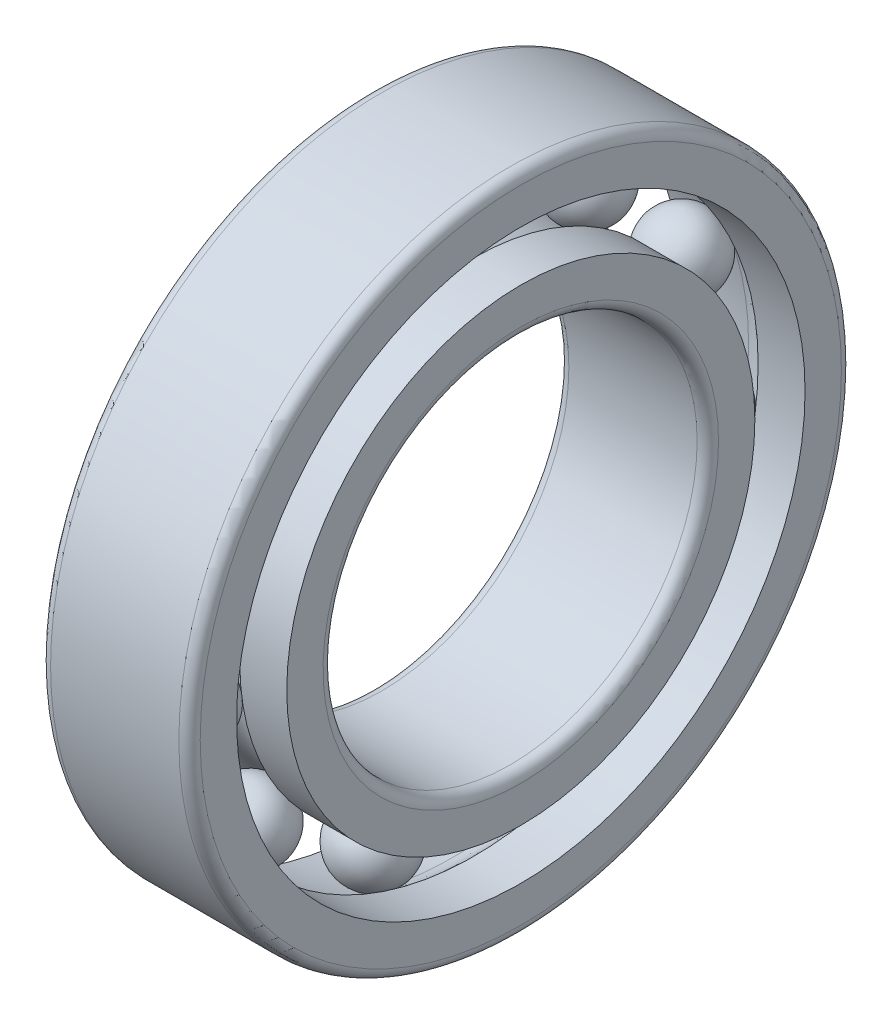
ISO-10303-21;
HEADER;
FILE_DESCRIPTION(('STEP AP214'),'2;1');
FILE_NAME('part.step','',(''),(''),'','','');
FILE_SCHEMA(('AUTOMOTIVE_DESIGN { 1 0 10303 214 1 1 1 1 }'));
ENDSEC;
DATA;
#1=APPLICATION_CONTEXT('core data for automotive mechanical design processes');
#2=APPLICATION_PROTOCOL_DEFINITION('international standard','automotive_design',2000,#1);
#3=PRODUCT_CONTEXT('',#1,'mechanical');
#4=PRODUCT('Part','Part','',(#3));
#5=PRODUCT_RELATED_PRODUCT_CATEGORY('part','',(#4));
#6=PRODUCT_DEFINITION_FORMATION('','',#4);
#7=PRODUCT_DEFINITION_CONTEXT('part definition',#1,'design');
#8=PRODUCT_DEFINITION('design','',#6,#7);
#9=PRODUCT_DEFINITION_SHAPE('','',#8);
#10=(LENGTH_UNIT() NAMED_UNIT(*) SI_UNIT(.MILLI.,.METRE.));
#11=(NAMED_UNIT(*) PLANE_ANGLE_UNIT() SI_UNIT($,.RADIAN.));
#12=(NAMED_UNIT(*) SI_UNIT($,.STERADIAN.) SOLID_ANGLE_UNIT());
#13=UNCERTAINTY_MEASURE_WITH_UNIT(LENGTH_MEASURE(1.E-05),#10,'distance_accuracy_value','');
#14=(GEOMETRIC_REPRESENTATION_CONTEXT(3) GLOBAL_UNCERTAINTY_ASSIGNED_CONTEXT((#13)) GLOBAL_UNIT_ASSIGNED_CONTEXT((#10,
#11,#12)) REPRESENTATION_CONTEXT('',''));
#15=CARTESIAN_POINT('',(0.,0.,0.));
#16=DIRECTION('',(0.,0.,1.));
#17=DIRECTION('',(1.,0.,0.));
#18=AXIS2_PLACEMENT_3D('',#15,#16,#17);
#19=CARTESIAN_POINT('',(7.,-23.2677046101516,6.83201450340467));
#20=DIRECTION('',(1.,0.,0.));
#21=DIRECTION('',(0.,-0.959492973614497,0.28173255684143));
#22=AXIS2_PLACEMENT_3D('',#19,#20,#21);
#23=SPHERICAL_SURFACE('',#22,3.51);
#24=CARTESIAN_POINT('',(3.49,-23.2677046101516,6.83201450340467));
#25=VERTEX_POINT('',#24);
#26=VERTEX_LOOP('',#25);
#27=FACE_BOUND('',#26,.T.);
#28=CARTESIAN_POINT('',(10.51,-23.2677046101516,6.83201450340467));
#29=VERTEX_POINT('',#28);
#30=VERTEX_LOOP('',#29);
#31=FACE_BOUND('',#30,.T.);
#32=ADVANCED_FACE('P0_F15',(#27,#31),#23,.T.);
#33=CLOSED_SHELL('',(#32));
#34=MANIFOLD_SOLID_BREP('P0_B1',#33);
#35=CARTESIAN_POINT('',(7.,0.,0.));
#36=DIRECTION('',(1.,0.,0.));
#37=DIRECTION('',(0.,0.,-1.));
#38=AXIS2_PLACEMENT_3D('',#35,#36,#37);
#39=TOROIDAL_SURFACE('',#38,24.25,3.51);
#40=CARTESIAN_POINT('',(9.60812173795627,0.,0.));
#41=DIRECTION('',(1.,0.,0.));
#42=DIRECTION('',(0.,0.,-1.));
#43=AXIS2_PLACEMENT_3D('',#40,#41,#42);
#44=CIRCLE('',#43,21.901);
#45=CARTESIAN_POINT('',(9.60812173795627,0.,-21.901));
#46=VERTEX_POINT('',#45);
#47=EDGE_CURVE('P1_E110',#46,#46,#44,.T.);
#48=ORIENTED_EDGE('',*,*,#47,.F.);
#49=EDGE_LOOP('',(#48));
#50=FACE_BOUND('',#49,.T.);
#51=CARTESIAN_POINT('',(4.39187826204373,0.,0.));
#52=DIRECTION('',(1.,0.,0.));
#53=DIRECTION('',(0.,0.,-1.));
#54=AXIS2_PLACEMENT_3D('',#51,#52,#53);
#55=CIRCLE('',#54,21.901);
#56=CARTESIAN_POINT('',(4.39187826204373,0.,-21.901));
#57=VERTEX_POINT('',#56);
#58=EDGE_CURVE('P1_E108',#57,#57,#55,.F.);
#59=ORIENTED_EDGE('',*,*,#58,.F.);
#60=EDGE_LOOP('',(#59));
#61=FACE_BOUND('',#60,.T.);
#62=ADVANCED_FACE('P1_F14',(#50,#61),#39,.F.);
#63=CARTESIAN_POINT('',(11.8040608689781,0.,0.));
#64=DIRECTION('',(1.,0.,0.));
#65=DIRECTION('',(0.,0.,-1.));
#66=AXIS2_PLACEMENT_3D('',#63,#64,#65);
#67=CYLINDRICAL_SURFACE('',#66,21.901);
#68=ORIENTED_EDGE('',*,*,#47,.T.);
#69=EDGE_LOOP('',(#68));
#70=FACE_BOUND('',#69,.T.);
#71=CARTESIAN_POINT('',(14.,0.,0.));
#72=DIRECTION('',(1.,0.,0.));
#73=DIRECTION('',(0.,0.,-1.));
#74=AXIS2_PLACEMENT_3D('',#71,#72,#73);
#75=CIRCLE('',#74,21.901);
#76=CARTESIAN_POINT('',(14.,0.,-21.901));
#77=VERTEX_POINT('',#76);
#78=EDGE_CURVE('P1_E17',#77,#77,#75,.T.);
#79=ORIENTED_EDGE('',*,*,#78,.F.);
#80=EDGE_LOOP('',(#79));
#81=FACE_BOUND('',#80,.T.);
#82=ADVANCED_FACE('P1_F83',(#70,#81),#67,.T.);
#83=CARTESIAN_POINT('',(2.19593913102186,0.,0.));
#84=DIRECTION('',(1.,0.,0.));
#85=DIRECTION('',(0.,0.,-1.));
#86=AXIS2_PLACEMENT_3D('',#83,#84,#85);
#87=CYLINDRICAL_SURFACE('',#86,21.901);
#88=CARTESIAN_POINT('',(0.,0.,0.));
#89=DIRECTION('',(1.,0.,0.));
#90=DIRECTION('',(0.,0.,-1.));
#91=AXIS2_PLACEMENT_3D('',#88,#89,#90);
#92=CIRCLE('',#91,21.901);
#93=CARTESIAN_POINT('',(0.,0.,-21.901));
#94=VERTEX_POINT('',#93);
#95=EDGE_CURVE('P1_E103',#94,#94,#92,.F.);
#96=ORIENTED_EDGE('',*,*,#95,.F.);
#97=EDGE_LOOP('',(#96));
#98=FACE_BOUND('',#97,.T.);
#99=ORIENTED_EDGE('',*,*,#58,.T.);
#100=EDGE_LOOP('',(#99));
#101=FACE_BOUND('',#100,.T.);
#102=ADVANCED_FACE('P1_F80',(#98,#101),#87,.T.);
#103=CARTESIAN_POINT('',(14.,19.7005,0.));
#104=DIRECTION('',(1.,0.,0.));
#105=DIRECTION('',(0.,0.,-1.));
#106=AXIS2_PLACEMENT_3D('',#103,#104,#105);
#107=PLANE('',#106);
#108=CARTESIAN_POINT('',(14.,0.,0.));
#109=DIRECTION('',(1.,0.,0.));
#110=DIRECTION('',(0.,1.,0.));
#111=AXIS2_PLACEMENT_3D('',#108,#109,#110);
#112=CIRCLE('',#111,18.5);
#113=CARTESIAN_POINT('',(14.,18.5,0.));
#114=VERTEX_POINT('',#113);
#115=EDGE_CURVE('P1_E64',#114,#114,#112,.T.);
#116=ORIENTED_EDGE('',*,*,#115,.F.);
#117=EDGE_LOOP('',(#116));
#118=FACE_BOUND('',#117,.T.);
#119=ORIENTED_EDGE('',*,*,#78,.T.);
#120=EDGE_LOOP('',(#119));
#121=FACE_BOUND('',#120,.T.);
#122=ADVANCED_FACE('P1_F70',(#118,#121),#107,.T.);
#123=CARTESIAN_POINT('',(0.,19.7005,0.));
#124=DIRECTION('',(-1.,0.,0.));
#125=DIRECTION('',(0.,0.,1.));
#126=AXIS2_PLACEMENT_3D('',#123,#124,#125);
#127=PLANE('',#126);
#128=CARTESIAN_POINT('',(0.,0.,0.));
#129=DIRECTION('',(-1.,0.,0.));
#130=DIRECTION('',(0.,1.,0.));
#131=AXIS2_PLACEMENT_3D('',#128,#129,#130);
#132=CIRCLE('',#131,18.5);
#133=CARTESIAN_POINT('',(0.,18.5,0.));
#134=VERTEX_POINT('',#133);
#135=EDGE_CURVE('P1_E26',#134,#134,#132,.T.);
#136=ORIENTED_EDGE('',*,*,#135,.F.);
#137=EDGE_LOOP('',(#136));
#138=FACE_BOUND('',#137,.T.);
#139=ORIENTED_EDGE('',*,*,#95,.T.);
#140=EDGE_LOOP('',(#139));
#141=FACE_BOUND('',#140,.T.);
#142=ADVANCED_FACE('P1_F79',(#138,#141),#127,.T.);
#143=CARTESIAN_POINT('',(13.,0.,0.));
#144=DIRECTION('',(1.,0.,0.));
#145=DIRECTION('',(0.,0.,-1.));
#146=AXIS2_PLACEMENT_3D('',#143,#144,#145);
#147=TOROIDAL_SURFACE('',#146,18.5,1.);
#148=CARTESIAN_POINT('',(13.,0.,0.));
#149=DIRECTION('',(1.,0.,0.));
#150=DIRECTION('',(0.,0.,-1.));
#151=AXIS2_PLACEMENT_3D('',#148,#149,#150);
#152=CIRCLE('',#151,17.5);
#153=CARTESIAN_POINT('',(13.,0.,-17.5));
#154=VERTEX_POINT('',#153);
#155=EDGE_CURVE('P1_E21',#154,#154,#152,.F.);
#156=ORIENTED_EDGE('',*,*,#155,.T.);
#157=EDGE_LOOP('',(#156));
#158=FACE_BOUND('',#157,.T.);
#159=ORIENTED_EDGE('',*,*,#115,.T.);
#160=EDGE_LOOP('',(#159));
#161=FACE_BOUND('',#160,.T.);
#162=ADVANCED_FACE('P1_F44',(#158,#161),#147,.T.);
#163=CARTESIAN_POINT('',(1.,0.,0.));
#164=DIRECTION('',(1.,0.,0.));
#165=DIRECTION('',(0.,0.,-1.));
#166=AXIS2_PLACEMENT_3D('',#163,#164,#165);
#167=TOROIDAL_SURFACE('',#166,18.5,1.);
#168=ORIENTED_EDGE('',*,*,#135,.T.);
#169=EDGE_LOOP('',(#168));
#170=FACE_BOUND('',#169,.T.);
#171=CARTESIAN_POINT('',(1.,0.,0.));
#172=DIRECTION('',(1.,0.,0.));
#173=DIRECTION('',(0.,0.,-1.));
#174=AXIS2_PLACEMENT_3D('',#171,#172,#173);
#175=CIRCLE('',#174,17.5);
#176=CARTESIAN_POINT('',(1.,0.,-17.5));
#177=VERTEX_POINT('',#176);
#178=EDGE_CURVE('P1_E10',#177,#177,#175,.T.);
#179=ORIENTED_EDGE('',*,*,#178,.T.);
#180=EDGE_LOOP('',(#179));
#181=FACE_BOUND('',#180,.T.);
#182=ADVANCED_FACE('P1_F38',(#170,#181),#167,.T.);
#183=CARTESIAN_POINT('',(7.,0.,0.));
#184=DIRECTION('',(1.,0.,0.));
#185=DIRECTION('',(0.,0.,-1.));
#186=AXIS2_PLACEMENT_3D('',#183,#184,#185);
#187=CYLINDRICAL_SURFACE('',#186,17.5);
#188=ORIENTED_EDGE('',*,*,#178,.F.);
#189=EDGE_LOOP('',(#188));
#190=FACE_BOUND('',#189,.T.);
#191=ORIENTED_EDGE('',*,*,#155,.F.);
#192=EDGE_LOOP('',(#191));
#193=FACE_BOUND('',#192,.T.);
#194=ADVANCED_FACE('P1_F43',(#190,#193),#187,.F.);
#195=CLOSED_SHELL('',(#62,#82,#102,#122,#142,#162,#182,#194));
#196=MANIFOLD_SOLID_BREP('P1_B1',#195);
#197=CARTESIAN_POINT('',(7.00000000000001,0.,0.));
#198=DIRECTION('',(1.,0.,0.));
#199=DIRECTION('',(0.,0.,-1.));
#200=AXIS2_PLACEMENT_3D('',#197,#198,#199);
#201=TOROIDAL_SURFACE('',#200,24.25,3.51);
#202=CARTESIAN_POINT('',(9.60812173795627,0.,0.));
#203=DIRECTION('',(1.,0.,0.));
#204=DIRECTION('',(0.,0.,-1.));
#205=AXIS2_PLACEMENT_3D('',#202,#203,#204);
#206=CIRCLE('',#205,26.599);
#207=CARTESIAN_POINT('',(9.60812173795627,0.,-26.599));
#208=VERTEX_POINT('',#207);
#209=EDGE_CURVE('P2_E108',#208,#208,#206,.T.);
#210=ORIENTED_EDGE('',*,*,#209,.T.);
#211=EDGE_LOOP('',(#210));
#212=FACE_BOUND('',#211,.T.);
#213=CARTESIAN_POINT('',(7.60950510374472,0.,0.));
#214=DIRECTION('',(-1.,0.,0.));
#215=DIRECTION('',(0.,1.,0.));
#216=AXIS2_PLACEMENT_3D('',#213,#214,#215);
#217=CIRCLE('',#216,27.7066752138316);
#218=CARTESIAN_POINT('',(7.60950510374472,27.7066752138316,0.));
#219=VERTEX_POINT('',#218);
#220=EDGE_CURVE('P2_E110',#219,#219,#217,.T.);
#221=ORIENTED_EDGE('',*,*,#220,.T.);
#222=EDGE_LOOP('',(#221));
#223=FACE_BOUND('',#222,.T.);
#224=ADVANCED_FACE('P2_F14',(#212,#223),#201,.F.);
#225=CARTESIAN_POINT('',(-1.33807461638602E-10,0.,0.));
#226=DIRECTION('',(-1.,0.,0.));
#227=DIRECTION('',(0.,0.,1.));
#228=AXIS2_PLACEMENT_3D('',#225,#226,#227);
#229=CONICAL_SURFACE('',#228,29.0484362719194,0.174532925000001);
#230=ORIENTED_EDGE('',*,*,#220,.F.);
#231=EDGE_LOOP('',(#230));
#232=FACE_BOUND('',#231,.T.);
#233=CARTESIAN_POINT('',(-1.33801390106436E-10,0.,0.));
#234=DIRECTION('',(-1.,0.,0.));
#235=DIRECTION('',(0.,0.,1.));
#236=AXIS2_PLACEMENT_3D('',#233,#234,#235);
#237=CIRCLE('',#236,29.0484362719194);
#238=CARTESIAN_POINT('',(-1.33801390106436E-10,0.,29.0484362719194));
#239=VERTEX_POINT('',#238);
#240=EDGE_CURVE('P2_E17',#239,#239,#237,.F.);
#241=ORIENTED_EDGE('',*,*,#240,.F.);
#242=EDGE_LOOP('',(#241));
#243=FACE_BOUND('',#242,.T.);
#244=ADVANCED_FACE('P2_F84',(#232,#243),#229,.F.);
#245=CARTESIAN_POINT('',(11.8040608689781,0.,0.));
#246=DIRECTION('',(1.,0.,0.));
#247=DIRECTION('',(0.,0.,-1.));
#248=AXIS2_PLACEMENT_3D('',#245,#246,#247);
#249=CYLINDRICAL_SURFACE('',#248,26.599);
#250=CARTESIAN_POINT('',(14.,0.,0.));
#251=DIRECTION('',(1.,0.,0.));
#252=DIRECTION('',(0.,0.,-1.));
#253=AXIS2_PLACEMENT_3D('',#250,#251,#252);
#254=CIRCLE('',#253,26.599);
#255=CARTESIAN_POINT('',(14.,0.,-26.599));
#256=VERTEX_POINT('',#255);
#257=EDGE_CURVE('P2_E103',#256,#256,#254,.F.);
#258=ORIENTED_EDGE('',*,*,#257,.F.);
#259=EDGE_LOOP('',(#258));
#260=FACE_BOUND('',#259,.T.);
#261=ORIENTED_EDGE('',*,*,#209,.F.);
#262=EDGE_LOOP('',(#261));
#263=FACE_BOUND('',#262,.T.);
#264=ADVANCED_FACE('P2_F80',(#260,#263),#249,.F.);
#265=CARTESIAN_POINT('',(0.,30.0242181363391,0.));
#266=DIRECTION('',(-1.,0.,0.));
#267=DIRECTION('',(0.,0.,1.));
#268=AXIS2_PLACEMENT_3D('',#265,#266,#267);
#269=PLANE('',#268);
#270=ORIENTED_EDGE('',*,*,#240,.T.);
#271=EDGE_LOOP('',(#270));
#272=FACE_BOUND('',#271,.T.);
#273=CARTESIAN_POINT('',(0.,0.,0.));
#274=DIRECTION('',(1.,0.,0.));
#275=DIRECTION('',(0.,1.,0.));
#276=AXIS2_PLACEMENT_3D('',#273,#274,#275);
#277=CIRCLE('',#276,30.);
#278=CARTESIAN_POINT('',(0.,30.,0.));
#279=VERTEX_POINT('',#278);
#280=EDGE_CURVE('P2_E64',#279,#279,#277,.T.);
#281=ORIENTED_EDGE('',*,*,#280,.F.);
#282=EDGE_LOOP('',(#281));
#283=FACE_BOUND('',#282,.T.);
#284=ADVANCED_FACE('P2_F70',(#272,#283),#269,.T.);
#285=CARTESIAN_POINT('',(14.,28.7995,0.));
#286=DIRECTION('',(1.,0.,0.));
#287=DIRECTION('',(0.,0.,-1.));
#288=AXIS2_PLACEMENT_3D('',#285,#286,#287);
#289=PLANE('',#288);
#290=ORIENTED_EDGE('',*,*,#257,.T.);
#291=EDGE_LOOP('',(#290));
#292=FACE_BOUND('',#291,.T.);
#293=CARTESIAN_POINT('',(14.,0.,0.));
#294=DIRECTION('',(-1.,0.,0.));
#295=DIRECTION('',(0.,1.,0.));
#296=AXIS2_PLACEMENT_3D('',#293,#294,#295);
#297=CIRCLE('',#296,30.);
#298=CARTESIAN_POINT('',(14.,30.,0.));
#299=VERTEX_POINT('',#298);
#300=EDGE_CURVE('P2_E26',#299,#299,#297,.T.);
#301=ORIENTED_EDGE('',*,*,#300,.F.);
#302=EDGE_LOOP('',(#301));
#303=FACE_BOUND('',#302,.T.);
#304=ADVANCED_FACE('P2_F79',(#292,#303),#289,.T.);
#305=CARTESIAN_POINT('',(1.,0.,0.));
#306=DIRECTION('',(1.,0.,0.));
#307=DIRECTION('',(0.,0.,-1.));
#308=AXIS2_PLACEMENT_3D('',#305,#306,#307);
#309=TOROIDAL_SURFACE('',#308,30.,1.);
#310=CARTESIAN_POINT('',(1.,0.,0.));
#311=DIRECTION('',(1.,0.,0.));
#312=DIRECTION('',(0.,0.,-1.));
#313=AXIS2_PLACEMENT_3D('',#310,#311,#312);
#314=CIRCLE('',#313,31.);
#315=CARTESIAN_POINT('',(1.,0.,-31.));
#316=VERTEX_POINT('',#315);
#317=EDGE_CURVE('P2_E21',#316,#316,#314,.T.);
#318=ORIENTED_EDGE('',*,*,#317,.F.);
#319=EDGE_LOOP('',(#318));
#320=FACE_BOUND('',#319,.T.);
#321=ORIENTED_EDGE('',*,*,#280,.T.);
#322=EDGE_LOOP('',(#321));
#323=FACE_BOUND('',#322,.T.);
#324=ADVANCED_FACE('P2_F44',(#320,#323),#309,.T.);
#325=CARTESIAN_POINT('',(13.,0.,0.));
#326=DIRECTION('',(1.,0.,0.));
#327=DIRECTION('',(0.,0.,-1.));
#328=AXIS2_PLACEMENT_3D('',#325,#326,#327);
#329=TOROIDAL_SURFACE('',#328,30.,1.);
#330=ORIENTED_EDGE('',*,*,#300,.T.);
#331=EDGE_LOOP('',(#330));
#332=FACE_BOUND('',#331,.T.);
#333=CARTESIAN_POINT('',(13.,0.,0.));
#334=DIRECTION('',(1.,0.,0.));
#335=DIRECTION('',(0.,0.,-1.));
#336=AXIS2_PLACEMENT_3D('',#333,#334,#335);
#337=CIRCLE('',#336,31.);
#338=CARTESIAN_POINT('',(13.,0.,-31.));
#339=VERTEX_POINT('',#338);
#340=EDGE_CURVE('P2_E10',#339,#339,#337,.F.);
#341=ORIENTED_EDGE('',*,*,#340,.F.);
#342=EDGE_LOOP('',(#341));
#343=FACE_BOUND('',#342,.T.);
#344=ADVANCED_FACE('P2_F38',(#332,#343),#329,.T.);
#345=CARTESIAN_POINT('',(7.,0.,0.));
#346=DIRECTION('',(1.,0.,0.));
#347=DIRECTION('',(0.,0.,-1.));
#348=AXIS2_PLACEMENT_3D('',#345,#346,#347);
#349=CYLINDRICAL_SURFACE('',#348,31.);
#350=ORIENTED_EDGE('',*,*,#340,.T.);
#351=EDGE_LOOP('',(#350));
#352=FACE_BOUND('',#351,.T.);
#353=ORIENTED_EDGE('',*,*,#317,.T.);
#354=EDGE_LOOP('',(#353));
#355=FACE_BOUND('',#354,.T.);
#356=ADVANCED_FACE('P2_F43',(#352,#355),#349,.T.);
#357=CLOSED_SHELL('',(#224,#244,#264,#284,#304,#324,#344,#356));
#358=MANIFOLD_SOLID_BREP('P2_B1',#357);
#359=CARTESIAN_POINT('',(7.,-15.8803727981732,18.3269271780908));
#360=DIRECTION('',(1.,0.,0.));
#361=DIRECTION('',(0.,-0.654860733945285,0.755749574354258));
#362=AXIS2_PLACEMENT_3D('',#359,#360,#361);
#363=SPHERICAL_SURFACE('',#362,3.51);
#364=CARTESIAN_POINT('',(3.49,-15.8803727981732,18.3269271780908));
#365=VERTEX_POINT('',#364);
#366=VERTEX_LOOP('',#365);
#367=FACE_BOUND('',#366,.T.);
#368=CARTESIAN_POINT('',(10.51,-15.8803727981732,18.3269271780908));
#369=VERTEX_POINT('',#368);
#370=VERTEX_LOOP('',#369);
#371=FACE_BOUND('',#370,.T.);
#372=ADVANCED_FACE('P3_F15',(#367,#371),#363,.T.);
#373=CLOSED_SHELL('',(#372));
#374=MANIFOLD_SOLID_BREP('P3_B1',#373);
#375=CARTESIAN_POINT('',(7.,10.0738140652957,22.0585758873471));
#376=DIRECTION('',(1.,0.,0.));
#377=DIRECTION('',(0.,0.415415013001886,0.909631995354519));
#378=AXIS2_PLACEMENT_3D('',#375,#376,#377);
#379=SPHERICAL_SURFACE('',#378,3.51);
#380=CARTESIAN_POINT('',(3.49,10.0738140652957,22.0585758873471));
#381=VERTEX_POINT('',#380);
#382=VERTEX_LOOP('',#381);
#383=FACE_BOUND('',#382,.T.);
#384=CARTESIAN_POINT('',(10.51,10.0738140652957,22.0585758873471));
#385=VERTEX_POINT('',#384);
#386=VERTEX_LOOP('',#385);
#387=FACE_BOUND('',#386,.T.);
#388=ADVANCED_FACE('P4_F15',(#383,#387),#379,.T.);
#389=CLOSED_SHELL('',(#388));
#390=MANIFOLD_SOLID_BREP('P4_B1',#389);
#391=CARTESIAN_POINT('',(7.,20.4003981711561,13.1105398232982));
#392=DIRECTION('',(1.,0.,0.));
#393=DIRECTION('',(0.,0.841253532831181,0.540640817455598));
#394=AXIS2_PLACEMENT_3D('',#391,#392,#393);
#395=SPHERICAL_SURFACE('',#394,3.51);
#396=CARTESIAN_POINT('',(3.49,20.4003981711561,13.1105398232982));
#397=VERTEX_POINT('',#396);
#398=VERTEX_LOOP('',#397);
#399=FACE_BOUND('',#398,.T.);
#400=CARTESIAN_POINT('',(10.51,20.4003981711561,13.1105398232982));
#401=VERTEX_POINT('',#400);
#402=VERTEX_LOOP('',#401);
#403=FACE_BOUND('',#402,.T.);
#404=ADVANCED_FACE('P5_F15',(#399,#403),#395,.T.);
#405=CLOSED_SHELL('',(#404));
#406=MANIFOLD_SOLID_BREP('P5_B1',#405);
#407=CARTESIAN_POINT('',(7.,20.4003981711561,-13.1105398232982));
#408=DIRECTION('',(1.,0.,0.));
#409=DIRECTION('',(0.,0.841253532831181,-0.540640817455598));
#410=AXIS2_PLACEMENT_3D('',#407,#408,#409);
#411=SPHERICAL_SURFACE('',#410,3.51);
#412=CARTESIAN_POINT('',(3.49,20.4003981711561,-13.1105398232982));
#413=VERTEX_POINT('',#412);
#414=VERTEX_LOOP('',#413);
#415=FACE_BOUND('',#414,.T.);
#416=CARTESIAN_POINT('',(10.51,20.4003981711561,-13.1105398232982));
#417=VERTEX_POINT('',#416);
#418=VERTEX_LOOP('',#417);
#419=FACE_BOUND('',#418,.T.);
#420=ADVANCED_FACE('P6_F15',(#415,#419),#411,.T.);
#421=CLOSED_SHELL('',(#420));
#422=MANIFOLD_SOLID_BREP('P6_B1',#421);
#423=CARTESIAN_POINT('',(7.,10.0738140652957,-22.0585758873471));
#424=DIRECTION('',(1.,0.,0.));
#425=DIRECTION('',(0.,0.415415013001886,-0.909631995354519));
#426=AXIS2_PLACEMENT_3D('',#423,#424,#425);
#427=SPHERICAL_SURFACE('',#426,3.51);
#428=CARTESIAN_POINT('',(3.49,10.0738140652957,-22.0585758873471));
#429=VERTEX_POINT('',#428);
#430=VERTEX_LOOP('',#429);
#431=FACE_BOUND('',#430,.T.);
#432=CARTESIAN_POINT('',(10.51,10.0738140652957,-22.0585758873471));
#433=VERTEX_POINT('',#432);
#434=VERTEX_LOOP('',#433);
#435=FACE_BOUND('',#434,.T.);
#436=ADVANCED_FACE('P7_F15',(#431,#435),#427,.T.);
#437=CLOSED_SHELL('',(#436));
#438=MANIFOLD_SOLID_BREP('P7_B1',#437);
#439=CARTESIAN_POINT('',(7.,-3.45113482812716,-24.0031699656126));
#440=DIRECTION('',(1.,0.,0.));
#441=DIRECTION('',(0.,-0.142314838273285,-0.989821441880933));
#442=AXIS2_PLACEMENT_3D('',#439,#440,#441);
#443=SPHERICAL_SURFACE('',#442,3.51);
#444=CARTESIAN_POINT('',(3.49,-3.45113482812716,-24.0031699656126));
#445=VERTEX_POINT('',#444);
#446=VERTEX_LOOP('',#445);
#447=FACE_BOUND('',#446,.T.);
#448=CARTESIAN_POINT('',(10.51,-3.45113482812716,-24.0031699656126));
#449=VERTEX_POINT('',#448);
#450=VERTEX_LOOP('',#449);
#451=FACE_BOUND('',#450,.T.);
#452=ADVANCED_FACE('P8_F15',(#447,#451),#443,.T.);
#453=CLOSED_SHELL('',(#452));
#454=MANIFOLD_SOLID_BREP('P8_B1',#453);
#455=CARTESIAN_POINT('',(7.,-15.8803727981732,-18.3269271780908));
#456=DIRECTION('',(1.,0.,0.));
#457=DIRECTION('',(0.,-0.654860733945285,-0.755749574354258));
#458=AXIS2_PLACEMENT_3D('',#455,#456,#457);
#459=SPHERICAL_SURFACE('',#458,3.51);
#460=CARTESIAN_POINT('',(3.49,-15.8803727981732,-18.3269271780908));
#461=VERTEX_POINT('',#460);
#462=VERTEX_LOOP('',#461);
#463=FACE_BOUND('',#462,.T.);
#464=CARTESIAN_POINT('',(10.51,-15.8803727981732,-18.3269271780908));
#465=VERTEX_POINT('',#464);
#466=VERTEX_LOOP('',#465);
#467=FACE_BOUND('',#466,.T.);
#468=ADVANCED_FACE('P9_F15',(#463,#467),#459,.T.);
#469=CLOSED_SHELL('',(#468));
#470=MANIFOLD_SOLID_BREP('P9_B1',#469);
#471=CARTESIAN_POINT('',(7.,-23.2677046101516,-6.83201450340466));
#472=DIRECTION('',(1.,0.,0.));
#473=DIRECTION('',(0.,-0.959492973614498,-0.281732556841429));
#474=AXIS2_PLACEMENT_3D('',#471,#472,#473);
#475=SPHERICAL_SURFACE('',#474,3.51);
#476=CARTESIAN_POINT('',(3.49,-23.2677046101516,-6.83201450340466));
#477=VERTEX_POINT('',#476);
#478=VERTEX_LOOP('',#477);
#479=FACE_BOUND('',#478,.T.);
#480=CARTESIAN_POINT('',(10.51,-23.2677046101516,-6.83201450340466));
#481=VERTEX_POINT('',#480);
#482=VERTEX_LOOP('',#481);
#483=FACE_BOUND('',#482,.T.);
#484=ADVANCED_FACE('P10_F15',(#479,#483),#475,.T.);
#485=CLOSED_SHELL('',(#484));
#486=MANIFOLD_SOLID_BREP('P10_B1',#485);
#487=CARTESIAN_POINT('',(7.,24.25,0.));
#488=DIRECTION('',(1.,0.,0.));
#489=DIRECTION('',(0.,1.,0.));
#490=AXIS2_PLACEMENT_3D('',#487,#488,#489);
#491=SPHERICAL_SURFACE('',#490,3.51);
#492=CARTESIAN_POINT('',(3.49,24.25,0.));
#493=VERTEX_POINT('',#492);
#494=VERTEX_LOOP('',#493);
#495=FACE_BOUND('',#494,.T.);
#496=CARTESIAN_POINT('',(10.51,24.25,0.));
#497=VERTEX_POINT('',#496);
#498=VERTEX_LOOP('',#497);
#499=FACE_BOUND('',#498,.T.);
#500=ADVANCED_FACE('P11_F15',(#495,#499),#491,.T.);
#501=CLOSED_SHELL('',(#500));
#502=MANIFOLD_SOLID_BREP('P11_B1',#501);
#503=CARTESIAN_POINT('',(7.,-3.45113482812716,24.0031699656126));
#504=DIRECTION('',(1.,0.,0.));
#505=DIRECTION('',(0.,-0.142314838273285,0.989821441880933));
#506=AXIS2_PLACEMENT_3D('',#503,#504,#505);
#507=SPHERICAL_SURFACE('',#506,3.51);
#508=CARTESIAN_POINT('',(3.49,-3.45113482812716,24.0031699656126));
#509=VERTEX_POINT('',#508);
#510=VERTEX_LOOP('',#509);
#511=FACE_BOUND('',#510,.T.);
#512=CARTESIAN_POINT('',(10.51,-3.45113482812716,24.0031699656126));
#513=VERTEX_POINT('',#512);
#514=VERTEX_LOOP('',#513);
#515=FACE_BOUND('',#514,.T.);
#516=ADVANCED_FACE('P12_F15',(#511,#515),#507,.T.);
#517=CLOSED_SHELL('',(#516));
#518=MANIFOLD_SOLID_BREP('P12_B1',#517);
#519=ADVANCED_BREP_SHAPE_REPRESENTATION('',(#18,#34,#196,#358,#374,#390,#406,#422,#438,#454,
#470,#486,#502,#518),#14);
#520=SHAPE_DEFINITION_REPRESENTATION(#9,#519);
ENDSEC;
END-ISO-10303-21;
